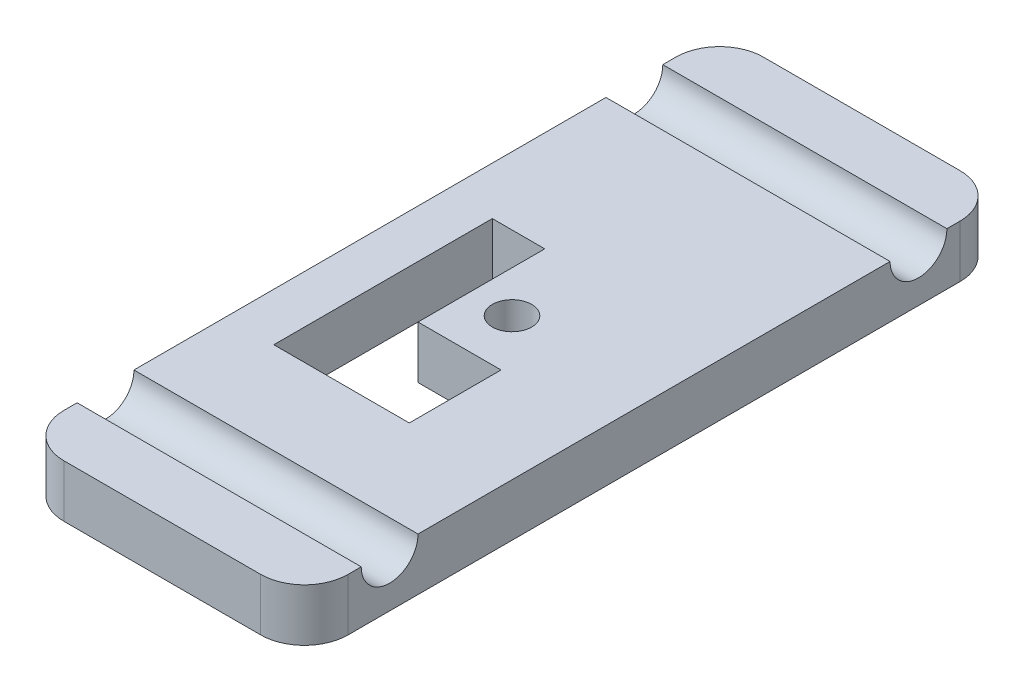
from build123d import *

# Parameters (mm, degrees)
SKETCH1_W           = 65
SKETCH1_H           = 160
SKETCH1_R           = 4.5
BOSS_EXTRUDE1_DEPTH = 12
SKETCH2_R           = 6.5
CUT_EXTRUDE1_DEPTH  = 77
FILLET1_R           = 10


with BuildPart() as part:
    # Sketch1 → Boss-Extrude1 (new body)
    with BuildSketch(Plane(origin=(0, 0, 0), x_dir=(1, 0, 0), z_dir=(0, 1, 0))):
        Rectangle(SKETCH1_W, SKETCH1_H)
        with Locations(Location((0, 0, 0), (0, 0, 270))):
            Circle(SKETCH1_R, mode=Mode.SUBTRACT)
        Polygon((-21.5, 17), (-9.5, 17), (-9.5, -12), (9.5, -12), (9.5, -33), (-21.5, -33), align=None, mode=Mode.SUBTRACT)
    extrude(amount=-BOSS_EXTRUDE1_DEPTH)

    # Sketch2 → Cut-Extrude1 (cut)
    with BuildSketch(Plane.ZY.offset(32.5)):
        with Locations((-60.5, 0)):
            Circle(SKETCH2_R)
        with Locations((60.5, 0)):
            Circle(SKETCH2_R)
    extrude(amount=-CUT_EXTRUDE1_DEPTH, mode=Mode.SUBTRACT)

    # Fillet1
    fillet1_edges = [part.edges().sort_by_distance(p)[0] for p in [
        (32.5, -6, 80),
        (-32.5, -6, 80),
        (-32.5, -6, -80),
        (32.5, -6, -80),
    ]]
    fillet(fillet1_edges, radius=FILLET1_R)


solid = part.part
